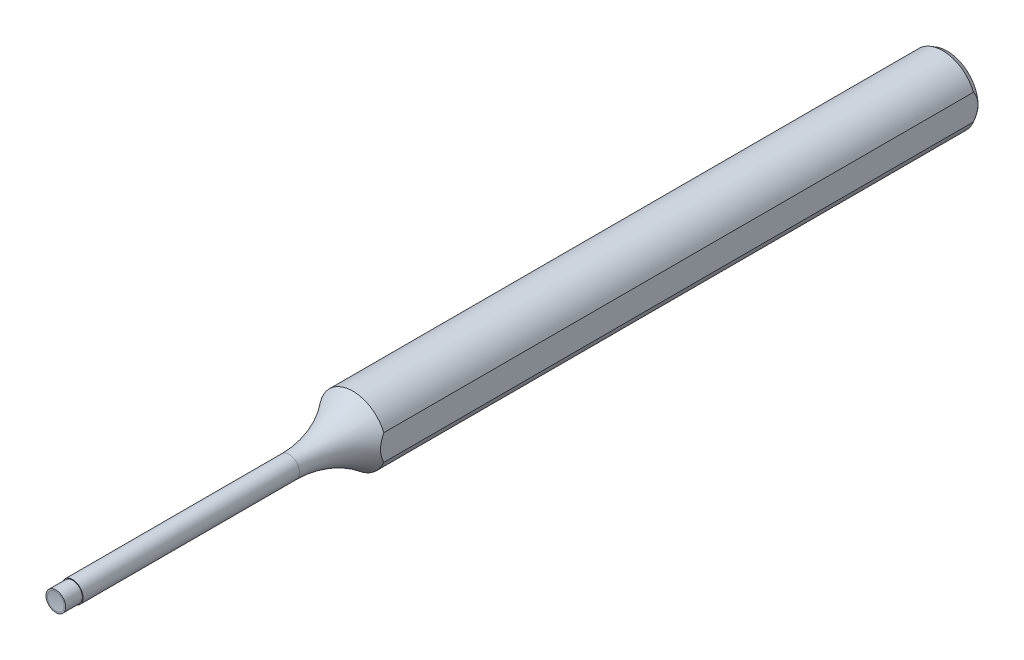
from build123d import *

# Parameters (mm, degrees)
SKETCH1_R           = 4.765
BOSS_EXTRUDE1_DEPTH = 127
SKETCH2_OUTSIDE_W   = 37.072
SKETCH2_OUTSIDE_H   = 37.072
SKETCH2_OUTSIDE_R   = 1.5
CUT_EXTRUDE1_DEPTH  = 42.333333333
SKETCH3_OUTSIDE_W   = 37.072
SKETCH3_OUTSIDE_H   = 37.072
SKETCH3_OUTSIDE_R   = 1.4
CUT_EXTRUDE2_DEPTH  = 2.3825
CHAMFER1_SIZE       = 0.635333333
CHAMFER1_SIZE2      = 0.366809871
SKETCH7_W           = 3.666687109
SKETCH7_H           = 3.66668711
CUT_EXTRUDE3_DEPTH  = 128.178655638


with BuildPart() as part:
    # Sketch1 → Boss-Extrude1 (new body)
    with BuildSketch(Plane.XY):
        Circle(SKETCH1_R)
    extrude(amount=-BOSS_EXTRUDE1_DEPTH)

    # Sketch2 outside → Cut-Extrude1 (cut)
    with BuildSketch(Plane.XY):
        Rectangle(SKETCH2_OUTSIDE_W, SKETCH2_OUTSIDE_H)
        Circle(SKETCH2_OUTSIDE_R, mode=Mode.SUBTRACT)
    extrude(amount=-CUT_EXTRUDE1_DEPTH, mode=Mode.SUBTRACT)

    # Sketch3 outside → Cut-Extrude2 (cut)
    with BuildSketch(Plane.XY):
        Rectangle(SKETCH3_OUTSIDE_W, SKETCH3_OUTSIDE_H)
        Circle(SKETCH3_OUTSIDE_R, mode=Mode.SUBTRACT)
    extrude(amount=-CUT_EXTRUDE2_DEPTH, mode=Mode.SUBTRACT)

    # Sketch4 → Cut-Revolve1 (revolve, cut)
    with BuildSketch(Plane(origin=(0, 0, 0), x_dir=(0, 0, -1), z_dir=(1, 0, 0)), mode=Mode.PRIVATE) as cut_revolve1_sk:
        with BuildLine():
            Line((0, 0), (0, 1.2))
            ThreePointArc((0, 1.2), (0.056870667, 0.60119748), (0.075852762, 0))
            Line((0.075852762, 0), (0, 0))
        make_face()
    revolve(cut_revolve1_sk.sketch.rotate(Axis((0, 0, 0), (0, 0, -1)), 180), axis=Axis((0, 0, 0), (0, 0, -1)), mode=Mode.SUBTRACT)

    # Chamfer1
    chamfer1_edges = [part.edges().sort_by_distance(p)[0] for p in [
        (-4.765, 0, -127),
    ]]
    chamfer1_side = [part.faces().sort_by_distance(p)[0] for p in [
        (-4.765, 0, -84.666666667),
    ]]
    chamfer(chamfer1_edges, length=CHAMFER1_SIZE, length2=CHAMFER1_SIZE2, reference=chamfer1_side[0])

    # Sketch5 → Revolve1 (revolve)
    with BuildSketch(Plane(origin=(0, 0, 0), x_dir=(0, 0, -1), z_dir=(1, 0, 0)), mode=Mode.PRIVATE) as revolve1_sk:
        with BuildLine():
            Line((42.333333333, 0), (33.240142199, 0))
            Line((33.240142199, 0), (33.240142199, 1.5))
            ThreePointArc((33.240142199, 1.5), (38.070937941, 2.340988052), (42.333333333, 4.765))
            Line((42.333333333, 4.765), (42.333333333, 0))
        make_face()
    revolve(revolve1_sk.sketch.rotate(Axis((0, 0, -42.333333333), (0, 0, 1)), 270), axis=Axis((0, 0, -42.333333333), (0, 0, 1)))

    # Sketch7 → Cut-Extrude3 (cut, through all)
    with BuildSketch(Plane(origin=(0, 0, -127), x_dir=(-1, 0, 0), z_dir=(0, 0, -1))):
        with Locations((-6.231533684, 0)):
            Rectangle(SKETCH7_W, SKETCH7_H)
    extrude(amount=-CUT_EXTRUDE3_DEPTH, mode=Mode.SUBTRACT)


solid = part.part
